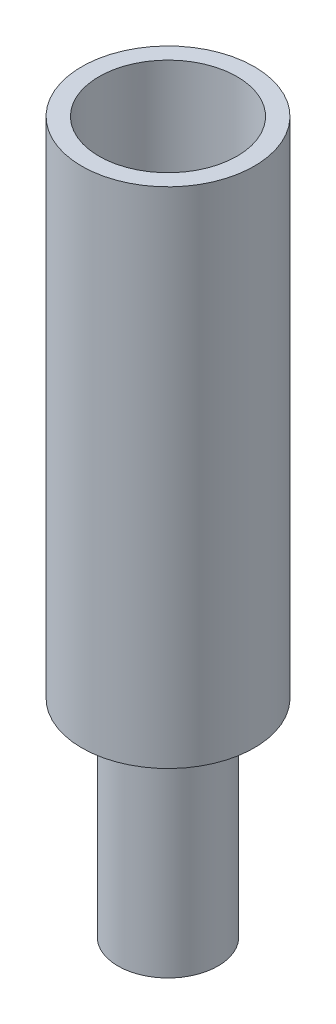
from build123d import *

# Parameters (mm, degrees)
SKETCH1_R           = 7.25
BOSS_EXTRUDE1_DEPTH = 30
SKETCH2_R           = 12.5
BOSS_EXTRUDE2_DEPTH = 3
SKETCH3_R           = 12.5
SKETCH3_R_2         = 10
EXTRUDE_THIN1_DEPTH = 70


with BuildPart() as part:
    # Sketch1 → Boss-Extrude1 (new body)
    with BuildSketch(Plane(origin=(0, 0, 0), x_dir=(1, 0, 0), z_dir=(0, 1, 0))):
        with Locations(Location((0, 0, 0), (0, 0, 270))):
            Circle(SKETCH1_R)
    extrude(amount=BOSS_EXTRUDE1_DEPTH)

    # Sketch2 → Boss-Extrude2 (add)
    with BuildSketch(Plane(origin=(0, 30, 0), x_dir=(1, 0, 0), z_dir=(0, 1, 0))):
        with Locations(Location((0, 0, 0), (0, 0, 270))):
            Circle(SKETCH2_R)
    extrude(amount=BOSS_EXTRUDE2_DEPTH)

    # Sketch3 → Extrude-Thin1 (add)
    with BuildSketch(Plane(origin=(0, 33, 0), x_dir=(1, 0, 0), z_dir=(0, 1, 0))):
        Circle(SKETCH3_R)
        Circle(SKETCH3_R_2, mode=Mode.SUBTRACT)
    extrude(amount=EXTRUDE_THIN1_DEPTH)


solid = part.part
